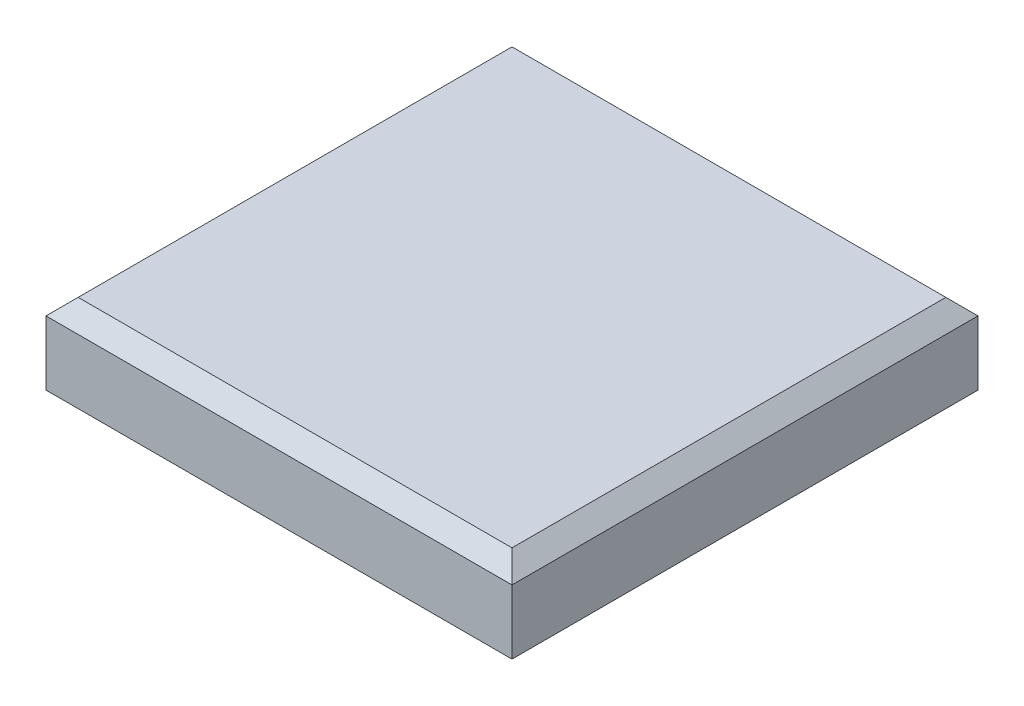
from build123d import *

# Parameters (mm, degrees)
SKETCH1_W           = 290
SKETCH1_H           = 290
BOSS_EXTRUDE1_DEPTH = 50
CHAMFER1_SIZE       = 10


with BuildPart() as part:
    # Sketch1 → Boss-Extrude1 (new body)
    with BuildSketch(Plane(origin=(0, 0, 0), x_dir=(1, 0, 0), z_dir=(0, 1, 0))):
        with Locations((0, 145)):
            Rectangle(SKETCH1_W, SKETCH1_H)
    extrude(amount=BOSS_EXTRUDE1_DEPTH)

    # Chamfer1
    chamfer1_edges = [part.edges().sort_by_distance(p)[0] for p in [
        (145, 50, -145),
        (0, 50, -290),
        (-145, 50, -145),
        (0, 50, 0),
    ]]
    chamfer(chamfer1_edges, length=CHAMFER1_SIZE)


solid = part.part
